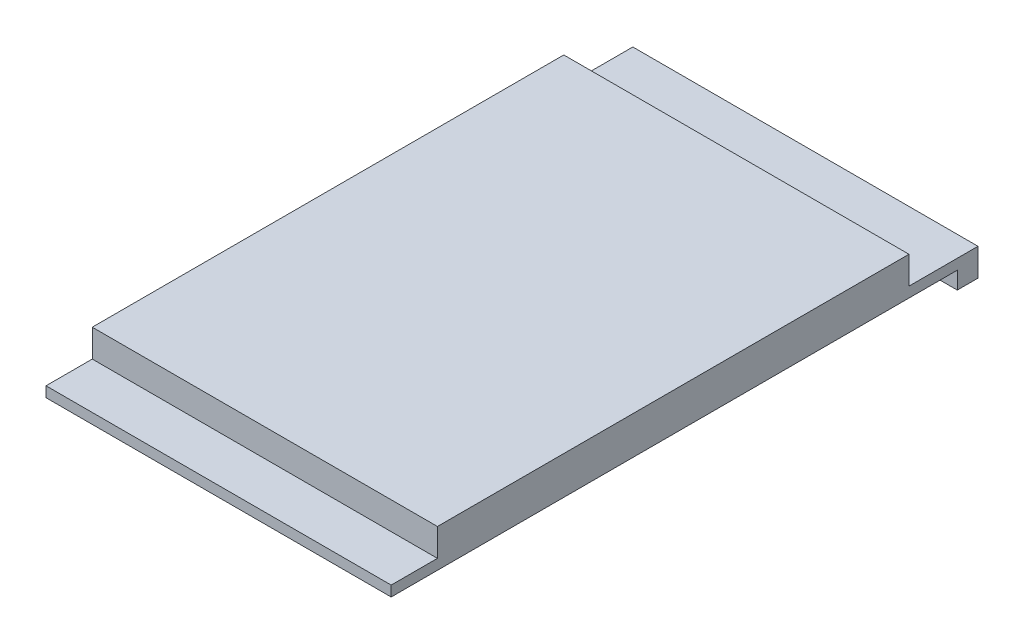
ISO-10303-21;
HEADER;
FILE_DESCRIPTION(('STEP AP214'),'2;1');
FILE_NAME('part.step','',(''),(''),'','','');
FILE_SCHEMA(('AUTOMOTIVE_DESIGN { 1 0 10303 214 1 1 1 1 }'));
ENDSEC;
DATA;
#1=APPLICATION_CONTEXT('core data for automotive mechanical design processes');
#2=APPLICATION_PROTOCOL_DEFINITION('international standard','automotive_design',2000,#1);
#3=PRODUCT_CONTEXT('',#1,'mechanical');
#4=PRODUCT('Part','Part','',(#3));
#5=PRODUCT_RELATED_PRODUCT_CATEGORY('part','',(#4));
#6=PRODUCT_DEFINITION_FORMATION('','',#4);
#7=PRODUCT_DEFINITION_CONTEXT('part definition',#1,'design');
#8=PRODUCT_DEFINITION('design','',#6,#7);
#9=PRODUCT_DEFINITION_SHAPE('','',#8);
#10=(LENGTH_UNIT() NAMED_UNIT(*) SI_UNIT(.MILLI.,.METRE.));
#11=(NAMED_UNIT(*) PLANE_ANGLE_UNIT() SI_UNIT($,.RADIAN.));
#12=(NAMED_UNIT(*) SI_UNIT($,.STERADIAN.) SOLID_ANGLE_UNIT());
#13=UNCERTAINTY_MEASURE_WITH_UNIT(LENGTH_MEASURE(1.E-05),#10,'distance_accuracy_value','');
#14=(GEOMETRIC_REPRESENTATION_CONTEXT(3) GLOBAL_UNCERTAINTY_ASSIGNED_CONTEXT((#13)) GLOBAL_UNIT_ASSIGNED_CONTEXT((#10,
#11,#12)) REPRESENTATION_CONTEXT('',''));
#15=CARTESIAN_POINT('',(0.,0.,0.));
#16=DIRECTION('',(0.,0.,1.));
#17=DIRECTION('',(1.,0.,0.));
#18=AXIS2_PLACEMENT_3D('',#15,#16,#17);
#19=CARTESIAN_POINT('',(-25.,8.,-42.5));
#20=DIRECTION('',(0.,0.,1.));
#21=DIRECTION('',(1.,0.,0.));
#22=AXIS2_PLACEMENT_3D('',#19,#20,#21);
#23=PLANE('',#22);
#24=DIRECTION('',(-1.,0.,0.));
#25=VECTOR('',#24,1.);
#26=CARTESIAN_POINT('',(-25.,4.,-42.5));
#27=LINE('',#26,#25);
#28=CARTESIAN_POINT('',(25.,4.,-42.5));
#29=VERTEX_POINT('',#28);
#30=CARTESIAN_POINT('',(-25.,4.,-42.5));
#31=VERTEX_POINT('',#30);
#32=EDGE_CURVE('E177',#29,#31,#27,.T.);
#33=ORIENTED_EDGE('',*,*,#32,.F.);
#34=DIRECTION('',(0.,-1.,0.));
#35=VECTOR('',#34,1.);
#36=CARTESIAN_POINT('',(25.,8.,-42.5));
#37=LINE('',#36,#35);
#38=CARTESIAN_POINT('',(25.,0.,-42.5));
#39=VERTEX_POINT('',#38);
#40=EDGE_CURVE('E11',#29,#39,#37,.T.);
#41=ORIENTED_EDGE('',*,*,#40,.T.);
#42=DIRECTION('',(-1.,0.,0.));
#43=VECTOR('',#42,1.);
#44=CARTESIAN_POINT('',(-25.,0.,-42.5));
#45=LINE('',#44,#43);
#46=CARTESIAN_POINT('',(-25.,0.,-42.5));
#47=VERTEX_POINT('',#46);
#48=EDGE_CURVE('E159',#39,#47,#45,.T.);
#49=ORIENTED_EDGE('',*,*,#48,.T.);
#50=DIRECTION('',(0.,-1.,0.));
#51=VECTOR('',#50,1.);
#52=CARTESIAN_POINT('',(-25.,8.,-42.5));
#53=LINE('',#52,#51);
#54=EDGE_CURVE('E43',#31,#47,#53,.T.);
#55=ORIENTED_EDGE('',*,*,#54,.F.);
#56=EDGE_LOOP('',(#33,#41,#49,#55));
#57=FACE_BOUND('',#56,.T.);
#58=ADVANCED_FACE('F35',(#57),#23,.F.);
#59=CARTESIAN_POINT('',(25.,8.,42.5));
#60=DIRECTION('',(-1.,0.,0.));
#61=DIRECTION('',(0.,0.,1.));
#62=AXIS2_PLACEMENT_3D('',#59,#60,#61);
#63=PLANE('',#62);
#64=DIRECTION('',(0.,0.,1.));
#65=VECTOR('',#64,1.);
#66=CARTESIAN_POINT('',(25.,2.5,42.5));
#67=LINE('',#66,#65);
#68=CARTESIAN_POINT('',(25.,2.5,-39.5));
#69=VERTEX_POINT('',#68);
#70=CARTESIAN_POINT('',(25.,2.5,42.5));
#71=VERTEX_POINT('',#70);
#72=EDGE_CURVE('E114',#69,#71,#67,.T.);
#73=ORIENTED_EDGE('',*,*,#72,.F.);
#74=DIRECTION('',(0.,-1.,0.));
#75=VECTOR('',#74,1.);
#76=CARTESIAN_POINT('',(25.,2.5,-39.5));
#77=LINE('',#76,#75);
#78=CARTESIAN_POINT('',(25.,0.,-39.5));
#79=VERTEX_POINT('',#78);
#80=EDGE_CURVE('E196',#69,#79,#77,.T.);
#81=ORIENTED_EDGE('',*,*,#80,.T.);
#82=DIRECTION('',(0.,0.,-1.));
#83=VECTOR('',#82,1.);
#84=CARTESIAN_POINT('',(25.,0.,42.5));
#85=LINE('',#84,#83);
#86=EDGE_CURVE('E163',#79,#39,#85,.T.);
#87=ORIENTED_EDGE('',*,*,#86,.T.);
#88=ORIENTED_EDGE('',*,*,#40,.F.);
#89=DIRECTION('',(0.,0.,-1.));
#90=VECTOR('',#89,1.);
#91=CARTESIAN_POINT('',(25.,4.,-42.5));
#92=LINE('',#91,#90);
#93=CARTESIAN_POINT('',(25.,4.,-32.5));
#94=VERTEX_POINT('',#93);
#95=EDGE_CURVE('E183',#94,#29,#92,.T.);
#96=ORIENTED_EDGE('',*,*,#95,.F.);
#97=DIRECTION('',(0.,1.,0.));
#98=VECTOR('',#97,1.);
#99=CARTESIAN_POINT('',(25.,4.,-32.5));
#100=LINE('',#99,#98);
#101=CARTESIAN_POINT('',(25.,8.,-32.5));
#102=VERTEX_POINT('',#101);
#103=EDGE_CURVE('E174',#94,#102,#100,.T.);
#104=ORIENTED_EDGE('',*,*,#103,.T.);
#105=DIRECTION('',(0.,0.,-1.));
#106=VECTOR('',#105,1.);
#107=CARTESIAN_POINT('',(25.,8.,42.5));
#108=LINE('',#107,#106);
#109=CARTESIAN_POINT('',(25.,8.,35.8));
#110=VERTEX_POINT('',#109);
#111=EDGE_CURVE('E141',#110,#102,#108,.T.);
#112=ORIENTED_EDGE('',*,*,#111,.F.);
#113=DIRECTION('',(0.,1.,0.));
#114=VECTOR('',#113,1.);
#115=CARTESIAN_POINT('',(25.,4.,35.8));
#116=LINE('',#115,#114);
#117=CARTESIAN_POINT('',(25.,4.,35.8));
#118=VERTEX_POINT('',#117);
#119=EDGE_CURVE('E58',#118,#110,#116,.T.);
#120=ORIENTED_EDGE('',*,*,#119,.F.);
#121=DIRECTION('',(0.,0.,-1.));
#122=VECTOR('',#121,1.);
#123=CARTESIAN_POINT('',(25.,4.,42.5));
#124=LINE('',#123,#122);
#125=CARTESIAN_POINT('',(25.,4.,42.5));
#126=VERTEX_POINT('',#125);
#127=EDGE_CURVE('E136',#126,#118,#124,.T.);
#128=ORIENTED_EDGE('',*,*,#127,.F.);
#129=DIRECTION('',(0.,-1.,0.));
#130=VECTOR('',#129,1.);
#131=CARTESIAN_POINT('',(25.,8.,42.5));
#132=LINE('',#131,#130);
#133=EDGE_CURVE('E130',#126,#71,#132,.T.);
#134=ORIENTED_EDGE('',*,*,#133,.T.);
#135=EDGE_LOOP('',(#73,#81,#87,#88,#96,#104,#112,#120,#128,#134));
#136=FACE_BOUND('',#135,.T.);
#137=ADVANCED_FACE('F37',(#136),#63,.F.);
#138=CARTESIAN_POINT('',(-25.,8.,42.5));
#139=DIRECTION('',(1.,0.,0.));
#140=DIRECTION('',(0.,0.,-1.));
#141=AXIS2_PLACEMENT_3D('',#138,#139,#140);
#142=PLANE('',#141);
#143=DIRECTION('',(0.,0.,1.));
#144=VECTOR('',#143,1.);
#145=CARTESIAN_POINT('',(-25.,0.,42.5));
#146=LINE('',#145,#144);
#147=CARTESIAN_POINT('',(-25.,0.,-39.5));
#148=VERTEX_POINT('',#147);
#149=EDGE_CURVE('E144',#47,#148,#146,.T.);
#150=ORIENTED_EDGE('',*,*,#149,.T.);
#151=DIRECTION('',(0.,-1.,0.));
#152=VECTOR('',#151,1.);
#153=CARTESIAN_POINT('',(-25.,2.5,-39.5));
#154=LINE('',#153,#152);
#155=CARTESIAN_POINT('',(-25.,2.5,-39.5));
#156=VERTEX_POINT('',#155);
#157=EDGE_CURVE('E50',#156,#148,#154,.T.);
#158=ORIENTED_EDGE('',*,*,#157,.F.);
#159=DIRECTION('',(0.,0.,-1.));
#160=VECTOR('',#159,1.);
#161=CARTESIAN_POINT('',(-25.,2.5,42.5));
#162=LINE('',#161,#160);
#163=CARTESIAN_POINT('',(-25.,2.5,42.5));
#164=VERTEX_POINT('',#163);
#165=EDGE_CURVE('E133',#164,#156,#162,.T.);
#166=ORIENTED_EDGE('',*,*,#165,.F.);
#167=DIRECTION('',(0.,-1.,0.));
#168=VECTOR('',#167,1.);
#169=CARTESIAN_POINT('',(-25.,8.,42.5));
#170=LINE('',#169,#168);
#171=CARTESIAN_POINT('',(-25.,4.,42.5));
#172=VERTEX_POINT('',#171);
#173=EDGE_CURVE('E132',#172,#164,#170,.T.);
#174=ORIENTED_EDGE('',*,*,#173,.F.);
#175=DIRECTION('',(0.,0.,1.));
#176=VECTOR('',#175,1.);
#177=CARTESIAN_POINT('',(-25.,4.,42.5));
#178=LINE('',#177,#176);
#179=CARTESIAN_POINT('',(-25.,4.,35.8));
#180=VERTEX_POINT('',#179);
#181=EDGE_CURVE('E195',#180,#172,#178,.T.);
#182=ORIENTED_EDGE('',*,*,#181,.F.);
#183=DIRECTION('',(0.,1.,0.));
#184=VECTOR('',#183,1.);
#185=CARTESIAN_POINT('',(-25.,4.,35.8));
#186=LINE('',#185,#184);
#187=CARTESIAN_POINT('',(-25.,8.,35.8));
#188=VERTEX_POINT('',#187);
#189=EDGE_CURVE('E181',#180,#188,#186,.T.);
#190=ORIENTED_EDGE('',*,*,#189,.T.);
#191=DIRECTION('',(0.,0.,1.));
#192=VECTOR('',#191,1.);
#193=CARTESIAN_POINT('',(-25.,8.,42.5));
#194=LINE('',#193,#192);
#195=CARTESIAN_POINT('',(-25.,8.,-32.5));
#196=VERTEX_POINT('',#195);
#197=EDGE_CURVE('E137',#196,#188,#194,.T.);
#198=ORIENTED_EDGE('',*,*,#197,.F.);
#199=DIRECTION('',(0.,1.,0.));
#200=VECTOR('',#199,1.);
#201=CARTESIAN_POINT('',(-25.,4.,-32.5));
#202=LINE('',#201,#200);
#203=CARTESIAN_POINT('',(-25.,4.,-32.5));
#204=VERTEX_POINT('',#203);
#205=EDGE_CURVE('E171',#204,#196,#202,.T.);
#206=ORIENTED_EDGE('',*,*,#205,.F.);
#207=DIRECTION('',(0.,0.,1.));
#208=VECTOR('',#207,1.);
#209=CARTESIAN_POINT('',(-25.,4.,-42.5));
#210=LINE('',#209,#208);
#211=EDGE_CURVE('E155',#31,#204,#210,.T.);
#212=ORIENTED_EDGE('',*,*,#211,.F.);
#213=ORIENTED_EDGE('',*,*,#54,.T.);
#214=EDGE_LOOP('',(#150,#158,#166,#174,#182,#190,#198,#206,#212,#213));
#215=FACE_BOUND('',#214,.T.);
#216=ADVANCED_FACE('F151',(#215),#142,.F.);
#217=CARTESIAN_POINT('',(-25.,8.,42.5));
#218=DIRECTION('',(0.,0.,-1.));
#219=DIRECTION('',(-1.,0.,0.));
#220=AXIS2_PLACEMENT_3D('',#217,#218,#219);
#221=PLANE('',#220);
#222=ORIENTED_EDGE('',*,*,#173,.T.);
#223=DIRECTION('',(-1.,0.,0.));
#224=VECTOR('',#223,1.);
#225=CARTESIAN_POINT('',(25.,2.5,42.5));
#226=LINE('',#225,#224);
#227=EDGE_CURVE('E117',#71,#164,#226,.T.);
#228=ORIENTED_EDGE('',*,*,#227,.F.);
#229=ORIENTED_EDGE('',*,*,#133,.F.);
#230=DIRECTION('',(1.,0.,0.));
#231=VECTOR('',#230,1.);
#232=CARTESIAN_POINT('',(-25.,4.,42.5));
#233=LINE('',#232,#231);
#234=EDGE_CURVE('E200',#172,#126,#233,.T.);
#235=ORIENTED_EDGE('',*,*,#234,.F.);
#236=EDGE_LOOP('',(#222,#228,#229,#235));
#237=FACE_BOUND('',#236,.T.);
#238=ADVANCED_FACE('F128',(#237),#221,.F.);
#239=CARTESIAN_POINT('',(0.,8.,0.));
#240=DIRECTION('',(0.,-1.,0.));
#241=DIRECTION('',(0.,0.,-1.));
#242=AXIS2_PLACEMENT_3D('',#239,#240,#241);
#243=PLANE('',#242);
#244=ORIENTED_EDGE('',*,*,#197,.T.);
#245=DIRECTION('',(-1.,0.,0.));
#246=VECTOR('',#245,1.);
#247=CARTESIAN_POINT('',(-25.,8.,35.8));
#248=LINE('',#247,#246);
#249=EDGE_CURVE('E193',#110,#188,#248,.T.);
#250=ORIENTED_EDGE('',*,*,#249,.F.);
#251=ORIENTED_EDGE('',*,*,#111,.T.);
#252=DIRECTION('',(1.,0.,0.));
#253=VECTOR('',#252,1.);
#254=CARTESIAN_POINT('',(-25.,8.,-32.5));
#255=LINE('',#254,#253);
#256=EDGE_CURVE('E179',#196,#102,#255,.T.);
#257=ORIENTED_EDGE('',*,*,#256,.F.);
#258=EDGE_LOOP('',(#244,#250,#251,#257));
#259=FACE_BOUND('',#258,.T.);
#260=ADVANCED_FACE('F228',(#259),#243,.F.);
#261=CARTESIAN_POINT('',(0.,0.,0.));
#262=DIRECTION('',(0.,-1.,0.));
#263=DIRECTION('',(0.,0.,-1.));
#264=AXIS2_PLACEMENT_3D('',#261,#262,#263);
#265=PLANE('',#264);
#266=DIRECTION('',(1.,0.,0.));
#267=VECTOR('',#266,1.);
#268=CARTESIAN_POINT('',(25.,0.,-39.5));
#269=LINE('',#268,#267);
#270=EDGE_CURVE('E123',#148,#79,#269,.T.);
#271=ORIENTED_EDGE('',*,*,#270,.F.);
#272=ORIENTED_EDGE('',*,*,#149,.F.);
#273=ORIENTED_EDGE('',*,*,#48,.F.);
#274=ORIENTED_EDGE('',*,*,#86,.F.);
#275=EDGE_LOOP('',(#271,#272,#273,#274));
#276=FACE_BOUND('',#275,.T.);
#277=ADVANCED_FACE('F164',(#276),#265,.T.);
#278=CARTESIAN_POINT('',(-25.,4.,-32.5));
#279=DIRECTION('',(0.,0.,1.));
#280=DIRECTION('',(1.,0.,0.));
#281=AXIS2_PLACEMENT_3D('',#278,#279,#280);
#282=PLANE('',#281);
#283=ORIENTED_EDGE('',*,*,#256,.T.);
#284=ORIENTED_EDGE('',*,*,#103,.F.);
#285=DIRECTION('',(1.,0.,0.));
#286=VECTOR('',#285,1.);
#287=CARTESIAN_POINT('',(-25.,4.,-32.5));
#288=LINE('',#287,#286);
#289=EDGE_CURVE('E185',#204,#94,#288,.T.);
#290=ORIENTED_EDGE('',*,*,#289,.F.);
#291=ORIENTED_EDGE('',*,*,#205,.T.);
#292=EDGE_LOOP('',(#283,#284,#290,#291));
#293=FACE_BOUND('',#292,.T.);
#294=ADVANCED_FACE('F231',(#293),#282,.F.);
#295=CARTESIAN_POINT('',(0.,4.,0.));
#296=DIRECTION('',(0.,1.,0.));
#297=DIRECTION('',(0.,0.,1.));
#298=AXIS2_PLACEMENT_3D('',#295,#296,#297);
#299=PLANE('',#298);
#300=ORIENTED_EDGE('',*,*,#211,.T.);
#301=ORIENTED_EDGE('',*,*,#289,.T.);
#302=ORIENTED_EDGE('',*,*,#95,.T.);
#303=ORIENTED_EDGE('',*,*,#32,.T.);
#304=EDGE_LOOP('',(#300,#301,#302,#303));
#305=FACE_BOUND('',#304,.T.);
#306=ADVANCED_FACE('F236',(#305),#299,.T.);
#307=CARTESIAN_POINT('',(-25.,4.,35.8));
#308=DIRECTION('',(0.,0.,-1.));
#309=DIRECTION('',(-1.,0.,0.));
#310=AXIS2_PLACEMENT_3D('',#307,#308,#309);
#311=PLANE('',#310);
#312=ORIENTED_EDGE('',*,*,#249,.T.);
#313=ORIENTED_EDGE('',*,*,#189,.F.);
#314=DIRECTION('',(-1.,0.,0.));
#315=VECTOR('',#314,1.);
#316=CARTESIAN_POINT('',(-25.,4.,35.8));
#317=LINE('',#316,#315);
#318=EDGE_CURVE('E190',#118,#180,#317,.T.);
#319=ORIENTED_EDGE('',*,*,#318,.F.);
#320=ORIENTED_EDGE('',*,*,#119,.T.);
#321=EDGE_LOOP('',(#312,#313,#319,#320));
#322=FACE_BOUND('',#321,.T.);
#323=ADVANCED_FACE('F216',(#322),#311,.F.);
#324=CARTESIAN_POINT('',(0.,4.,0.));
#325=DIRECTION('',(0.,-1.,0.));
#326=DIRECTION('',(0.,0.,-1.));
#327=AXIS2_PLACEMENT_3D('',#324,#325,#326);
#328=PLANE('',#327);
#329=ORIENTED_EDGE('',*,*,#181,.T.);
#330=ORIENTED_EDGE('',*,*,#234,.T.);
#331=ORIENTED_EDGE('',*,*,#127,.T.);
#332=ORIENTED_EDGE('',*,*,#318,.T.);
#333=EDGE_LOOP('',(#329,#330,#331,#332));
#334=FACE_BOUND('',#333,.T.);
#335=ADVANCED_FACE('F209',(#334),#328,.F.);
#336=CARTESIAN_POINT('',(25.,2.5,-39.5));
#337=DIRECTION('',(0.,0.,-1.));
#338=DIRECTION('',(-1.,0.,0.));
#339=AXIS2_PLACEMENT_3D('',#336,#337,#338);
#340=PLANE('',#339);
#341=ORIENTED_EDGE('',*,*,#270,.T.);
#342=ORIENTED_EDGE('',*,*,#80,.F.);
#343=DIRECTION('',(1.,0.,0.));
#344=VECTOR('',#343,1.);
#345=CARTESIAN_POINT('',(25.,2.5,-39.5));
#346=LINE('',#345,#344);
#347=EDGE_CURVE('E119',#156,#69,#346,.T.);
#348=ORIENTED_EDGE('',*,*,#347,.F.);
#349=ORIENTED_EDGE('',*,*,#157,.T.);
#350=EDGE_LOOP('',(#341,#342,#348,#349));
#351=FACE_BOUND('',#350,.T.);
#352=ADVANCED_FACE('F207',(#351),#340,.F.);
#353=CARTESIAN_POINT('',(0.,2.5,0.));
#354=DIRECTION('',(0.,1.,0.));
#355=DIRECTION('',(0.,0.,1.));
#356=AXIS2_PLACEMENT_3D('',#353,#354,#355);
#357=PLANE('',#356);
#358=ORIENTED_EDGE('',*,*,#72,.T.);
#359=ORIENTED_EDGE('',*,*,#227,.T.);
#360=ORIENTED_EDGE('',*,*,#165,.T.);
#361=ORIENTED_EDGE('',*,*,#347,.T.);
#362=EDGE_LOOP('',(#358,#359,#360,#361));
#363=FACE_BOUND('',#362,.T.);
#364=ADVANCED_FACE('F116',(#363),#357,.F.);
#365=CLOSED_SHELL('',(#58,#137,#216,#238,#260,#277,#294,#306,#323,#335,#352,#364));
#366=MANIFOLD_SOLID_BREP('B2',#365);
#367=ADVANCED_BREP_SHAPE_REPRESENTATION('',(#18,#366),#14);
#368=SHAPE_DEFINITION_REPRESENTATION(#9,#367);
ENDSEC;
END-ISO-10303-21;
